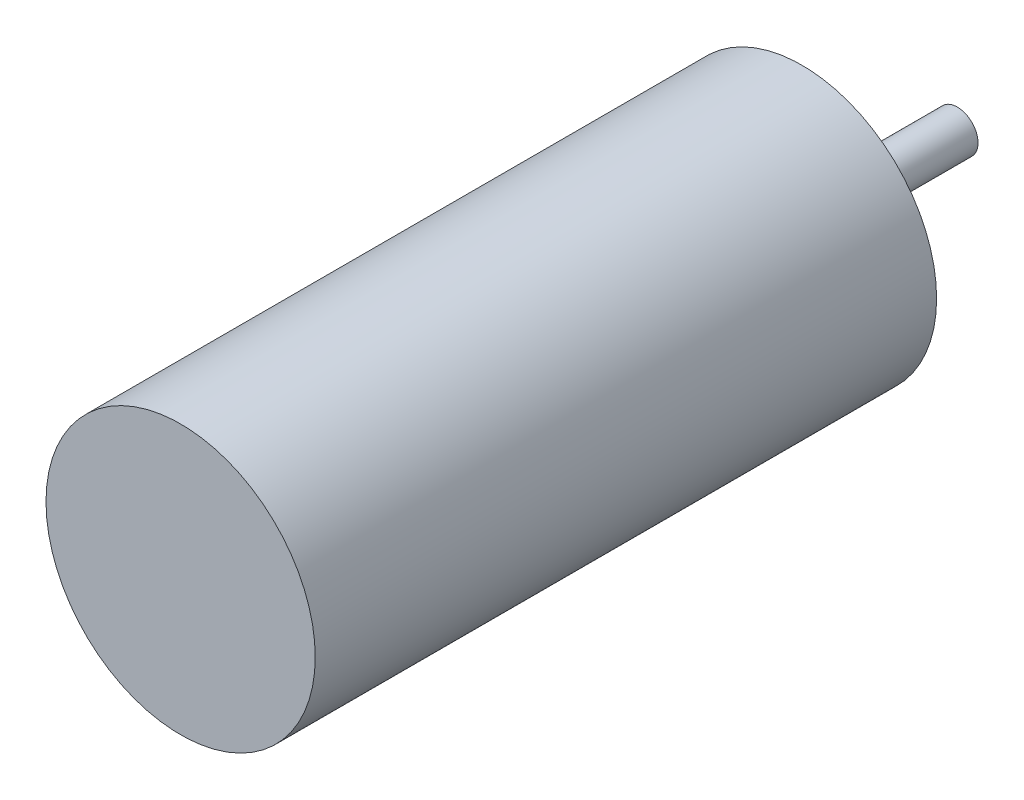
ISO-10303-21;
HEADER;
FILE_DESCRIPTION(('STEP AP214'),'2;1');
FILE_NAME('part.step','',(''),(''),'','','');
FILE_SCHEMA(('AUTOMOTIVE_DESIGN { 1 0 10303 214 1 1 1 1 }'));
ENDSEC;
DATA;
#1=APPLICATION_CONTEXT('core data for automotive mechanical design processes');
#2=APPLICATION_PROTOCOL_DEFINITION('international standard','automotive_design',2000,#1);
#3=PRODUCT_CONTEXT('',#1,'mechanical');
#4=PRODUCT('Part','Part','',(#3));
#5=PRODUCT_RELATED_PRODUCT_CATEGORY('part','',(#4));
#6=PRODUCT_DEFINITION_FORMATION('','',#4);
#7=PRODUCT_DEFINITION_CONTEXT('part definition',#1,'design');
#8=PRODUCT_DEFINITION('design','',#6,#7);
#9=PRODUCT_DEFINITION_SHAPE('','',#8);
#10=(LENGTH_UNIT() NAMED_UNIT(*) SI_UNIT(.MILLI.,.METRE.));
#11=(NAMED_UNIT(*) PLANE_ANGLE_UNIT() SI_UNIT($,.RADIAN.));
#12=(NAMED_UNIT(*) SI_UNIT($,.STERADIAN.) SOLID_ANGLE_UNIT());
#13=UNCERTAINTY_MEASURE_WITH_UNIT(LENGTH_MEASURE(1.E-05),#10,'distance_accuracy_value','');
#14=(GEOMETRIC_REPRESENTATION_CONTEXT(3) GLOBAL_UNCERTAINTY_ASSIGNED_CONTEXT((#13)) GLOBAL_UNIT_ASSIGNED_CONTEXT((#10,
#11,#12)) REPRESENTATION_CONTEXT('',''));
#15=CARTESIAN_POINT('',(0.,0.,0.));
#16=DIRECTION('',(0.,0.,1.));
#17=DIRECTION('',(1.,0.,0.));
#18=AXIS2_PLACEMENT_3D('',#15,#16,#17);
#19=CARTESIAN_POINT('',(0.,0.,60.));
#20=DIRECTION('',(0.,0.,-1.));
#21=DIRECTION('',(-1.,0.,0.));
#22=AXIS2_PLACEMENT_3D('',#19,#20,#21);
#23=CYLINDRICAL_SURFACE('',#22,13.);
#24=CARTESIAN_POINT('',(0.,0.,60.));
#25=DIRECTION('',(0.,0.,1.));
#26=DIRECTION('',(1.,0.,0.));
#27=AXIS2_PLACEMENT_3D('',#24,#25,#26);
#28=CIRCLE('',#27,13.);
#29=CARTESIAN_POINT('',(13.,0.,60.));
#30=VERTEX_POINT('',#29);
#31=EDGE_CURVE('E44',#30,#30,#28,.T.);
#32=ORIENTED_EDGE('',*,*,#31,.F.);
#33=EDGE_LOOP('',(#32));
#34=FACE_BOUND('',#33,.T.);
#35=CARTESIAN_POINT('',(0.,0.,0.));
#36=DIRECTION('',(0.,0.,1.));
#37=DIRECTION('',(1.,0.,0.));
#38=AXIS2_PLACEMENT_3D('',#35,#36,#37);
#39=CIRCLE('',#38,13.);
#40=CARTESIAN_POINT('',(13.,0.,0.));
#41=VERTEX_POINT('',#40);
#42=EDGE_CURVE('E39',#41,#41,#39,.T.);
#43=ORIENTED_EDGE('',*,*,#42,.T.);
#44=EDGE_LOOP('',(#43));
#45=FACE_BOUND('',#44,.T.);
#46=ADVANCED_FACE('F36',(#34,#45),#23,.T.);
#47=CARTESIAN_POINT('',(0.,0.,60.));
#48=DIRECTION('',(0.,0.,1.));
#49=DIRECTION('',(1.,0.,0.));
#50=AXIS2_PLACEMENT_3D('',#47,#48,#49);
#51=PLANE('',#50);
#52=ORIENTED_EDGE('',*,*,#31,.T.);
#53=EDGE_LOOP('',(#52));
#54=FACE_BOUND('',#53,.T.);
#55=ADVANCED_FACE('F85',(#54),#51,.T.);
#56=CARTESIAN_POINT('',(0.,0.,0.));
#57=DIRECTION('',(0.,0.,1.));
#58=DIRECTION('',(1.,0.,0.));
#59=AXIS2_PLACEMENT_3D('',#56,#57,#58);
#60=PLANE('',#59);
#61=CARTESIAN_POINT('',(9.,0.,0.));
#62=DIRECTION('',(0.,0.,-1.));
#63=DIRECTION('',(-1.,0.,0.));
#64=AXIS2_PLACEMENT_3D('',#61,#62,#63);
#65=CIRCLE('',#64,1.5);
#66=CARTESIAN_POINT('',(7.5,0.,0.));
#67=VERTEX_POINT('',#66);
#68=EDGE_CURVE('E64',#67,#67,#65,.T.);
#69=ORIENTED_EDGE('',*,*,#68,.F.);
#70=EDGE_LOOP('',(#69));
#71=FACE_BOUND('',#70,.T.);
#72=CARTESIAN_POINT('',(-9.,0.,0.));
#73=DIRECTION('',(0.,0.,-1.));
#74=DIRECTION('',(-1.,0.,0.));
#75=AXIS2_PLACEMENT_3D('',#72,#73,#74);
#76=CIRCLE('',#75,1.5);
#77=CARTESIAN_POINT('',(-10.5,0.,0.));
#78=VERTEX_POINT('',#77);
#79=EDGE_CURVE('E56',#78,#78,#76,.T.);
#80=ORIENTED_EDGE('',*,*,#79,.F.);
#81=EDGE_LOOP('',(#80));
#82=FACE_BOUND('',#81,.T.);
#83=CARTESIAN_POINT('',(0.,0.,0.));
#84=DIRECTION('',(0.,0.,-1.));
#85=DIRECTION('',(-1.,0.,0.));
#86=AXIS2_PLACEMENT_3D('',#83,#84,#85);
#87=CIRCLE('',#86,2.);
#88=CARTESIAN_POINT('',(-2.,0.,0.));
#89=VERTEX_POINT('',#88);
#90=EDGE_CURVE('E10',#89,#89,#87,.T.);
#91=ORIENTED_EDGE('',*,*,#90,.F.);
#92=EDGE_LOOP('',(#91));
#93=FACE_BOUND('',#92,.T.);
#94=ORIENTED_EDGE('',*,*,#42,.F.);
#95=EDGE_LOOP('',(#94));
#96=FACE_BOUND('',#95,.T.);
#97=ADVANCED_FACE('F81',(#71,#82,#93,#96),#60,.F.);
#98=CARTESIAN_POINT('',(0.,0.,-15.));
#99=DIRECTION('',(0.,0.,1.));
#100=DIRECTION('',(1.,0.,0.));
#101=AXIS2_PLACEMENT_3D('',#98,#99,#100);
#102=CYLINDRICAL_SURFACE('',#101,2.);
#103=CARTESIAN_POINT('',(0.,0.,-15.));
#104=DIRECTION('',(0.,0.,-1.));
#105=DIRECTION('',(-1.,0.,0.));
#106=AXIS2_PLACEMENT_3D('',#103,#104,#105);
#107=CIRCLE('',#106,2.);
#108=CARTESIAN_POINT('',(-2.,0.,-15.));
#109=VERTEX_POINT('',#108);
#110=EDGE_CURVE('E51',#109,#109,#107,.T.);
#111=ORIENTED_EDGE('',*,*,#110,.F.);
#112=EDGE_LOOP('',(#111));
#113=FACE_BOUND('',#112,.T.);
#114=ORIENTED_EDGE('',*,*,#90,.T.);
#115=EDGE_LOOP('',(#114));
#116=FACE_BOUND('',#115,.T.);
#117=ADVANCED_FACE('F84',(#113,#116),#102,.T.);
#118=CARTESIAN_POINT('',(0.,0.,-15.));
#119=DIRECTION('',(0.,0.,-1.));
#120=DIRECTION('',(-1.,0.,0.));
#121=AXIS2_PLACEMENT_3D('',#118,#119,#120);
#122=PLANE('',#121);
#123=ORIENTED_EDGE('',*,*,#110,.T.);
#124=EDGE_LOOP('',(#123));
#125=FACE_BOUND('',#124,.T.);
#126=ADVANCED_FACE('F107',(#125),#122,.T.);
#127=CARTESIAN_POINT('',(-9.,0.,7.));
#128=DIRECTION('',(0.,0.,-1.));
#129=DIRECTION('',(-1.,0.,0.));
#130=AXIS2_PLACEMENT_3D('',#127,#128,#129);
#131=CYLINDRICAL_SURFACE('',#130,1.5);
#132=CARTESIAN_POINT('',(-9.,0.,7.));
#133=DIRECTION('',(0.,0.,-1.));
#134=DIRECTION('',(-1.,0.,0.));
#135=AXIS2_PLACEMENT_3D('',#132,#133,#134);
#136=CIRCLE('',#135,1.5);
#137=CARTESIAN_POINT('',(-10.5,0.,7.));
#138=VERTEX_POINT('',#137);
#139=EDGE_CURVE('E60',#138,#138,#136,.T.);
#140=ORIENTED_EDGE('',*,*,#139,.F.);
#141=EDGE_LOOP('',(#140));
#142=FACE_BOUND('',#141,.T.);
#143=ORIENTED_EDGE('',*,*,#79,.T.);
#144=EDGE_LOOP('',(#143));
#145=FACE_BOUND('',#144,.T.);
#146=ADVANCED_FACE('F111',(#142,#145),#131,.F.);
#147=CARTESIAN_POINT('',(-9.,0.,7.));
#148=DIRECTION('',(0.,0.,-1.));
#149=DIRECTION('',(-1.,0.,0.));
#150=AXIS2_PLACEMENT_3D('',#147,#148,#149);
#151=PLANE('',#150);
#152=ORIENTED_EDGE('',*,*,#139,.T.);
#153=EDGE_LOOP('',(#152));
#154=FACE_BOUND('',#153,.T.);
#155=ADVANCED_FACE('F77',(#154),#151,.T.);
#156=CARTESIAN_POINT('',(9.,0.,7.));
#157=DIRECTION('',(0.,0.,-1.));
#158=DIRECTION('',(-1.,0.,0.));
#159=AXIS2_PLACEMENT_3D('',#156,#157,#158);
#160=CYLINDRICAL_SURFACE('',#159,1.5);
#161=CARTESIAN_POINT('',(9.,0.,7.));
#162=DIRECTION('',(0.,0.,-1.));
#163=DIRECTION('',(-1.,0.,0.));
#164=AXIS2_PLACEMENT_3D('',#161,#162,#163);
#165=CIRCLE('',#164,1.5);
#166=CARTESIAN_POINT('',(7.5,0.,7.));
#167=VERTEX_POINT('',#166);
#168=EDGE_CURVE('E55',#167,#167,#165,.T.);
#169=ORIENTED_EDGE('',*,*,#168,.F.);
#170=EDGE_LOOP('',(#169));
#171=FACE_BOUND('',#170,.T.);
#172=ORIENTED_EDGE('',*,*,#68,.T.);
#173=EDGE_LOOP('',(#172));
#174=FACE_BOUND('',#173,.T.);
#175=ADVANCED_FACE('F74',(#171,#174),#160,.F.);
#176=CARTESIAN_POINT('',(9.,0.,7.));
#177=DIRECTION('',(0.,0.,-1.));
#178=DIRECTION('',(-1.,0.,0.));
#179=AXIS2_PLACEMENT_3D('',#176,#177,#178);
#180=PLANE('',#179);
#181=ORIENTED_EDGE('',*,*,#168,.T.);
#182=EDGE_LOOP('',(#181));
#183=FACE_BOUND('',#182,.T.);
#184=ADVANCED_FACE('F72',(#183),#180,.T.);
#185=CLOSED_SHELL('',(#46,#55,#97,#117,#126,#146,#155,#175,#184));
#186=MANIFOLD_SOLID_BREP('B2',#185);
#187=ADVANCED_BREP_SHAPE_REPRESENTATION('',(#18,#186),#14);
#188=SHAPE_DEFINITION_REPRESENTATION(#9,#187);
ENDSEC;
END-ISO-10303-21;
